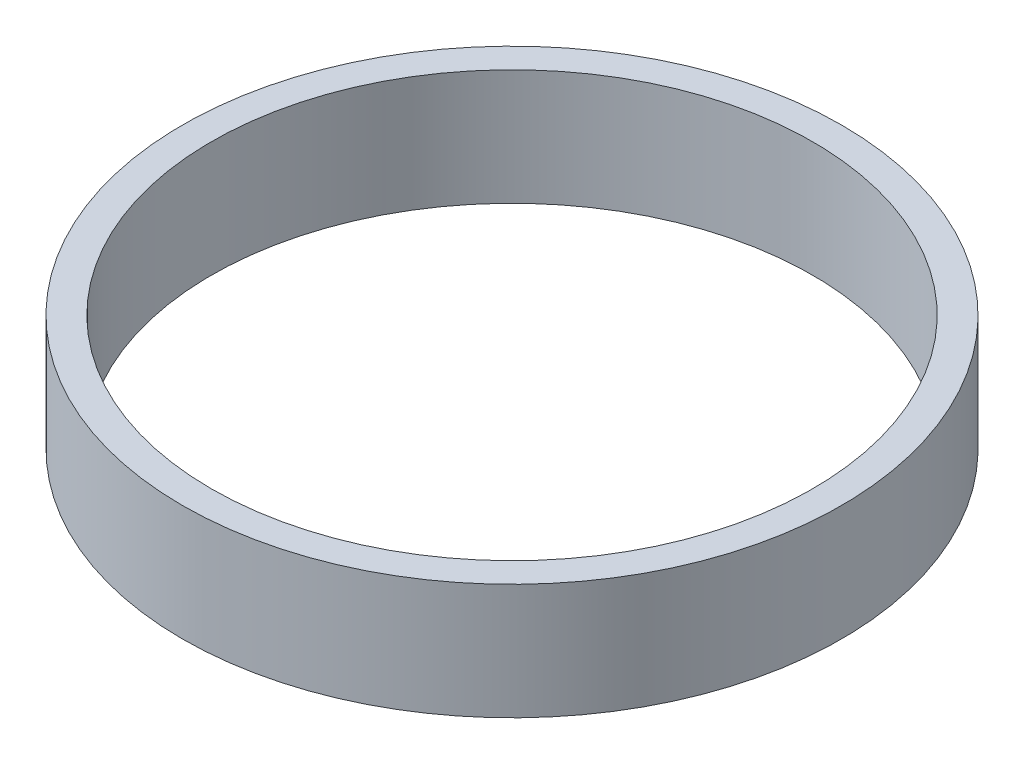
from build123d import *

# Parameters (mm, degrees)
SKETCH2_R           = 72.39
SKETCH2_R_2         = 66.04
BOSS_EXTRUDE1_DEPTH = 12.7


with BuildPart() as part:
    # Sketch2 → Boss-Extrude1 (new, symmetric)
    with BuildSketch(Plane(origin=(0, 0, 0), x_dir=(1, 0, 0), z_dir=(0, 1, 0))):
        with Locations(Location((0, 0, 0), (0, 0, 270))):
            Circle(SKETCH2_R)
        with Locations(Location((0, 0, 0), (0, 0, 270))):
            Circle(SKETCH2_R_2, mode=Mode.SUBTRACT)
    extrude(amount=BOSS_EXTRUDE1_DEPTH, both=True)


solid = part.part
